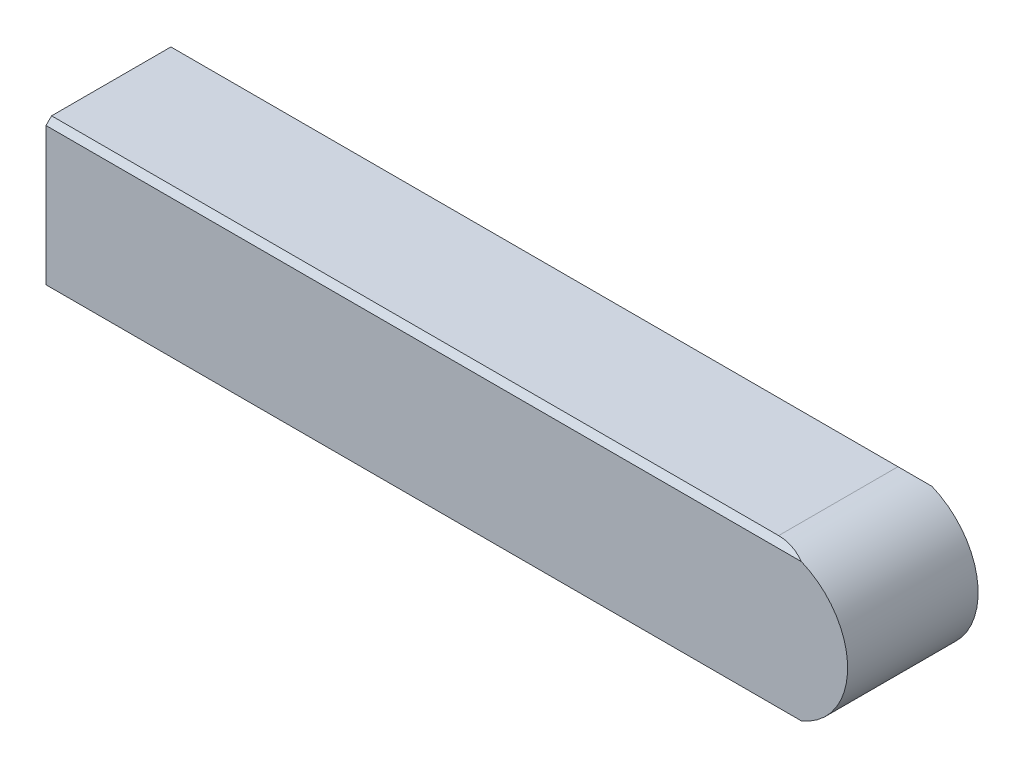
ISO-10303-21;
HEADER;
FILE_DESCRIPTION(('STEP AP214'),'2;1');
FILE_NAME('part.step','',(''),(''),'','','');
FILE_SCHEMA(('AUTOMOTIVE_DESIGN { 1 0 10303 214 1 1 1 1 }'));
ENDSEC;
DATA;
#1=APPLICATION_CONTEXT('core data for automotive mechanical design processes');
#2=APPLICATION_PROTOCOL_DEFINITION('international standard','automotive_design',2000,#1);
#3=PRODUCT_CONTEXT('',#1,'mechanical');
#4=PRODUCT('Part','Part','',(#3));
#5=PRODUCT_RELATED_PRODUCT_CATEGORY('part','',(#4));
#6=PRODUCT_DEFINITION_FORMATION('','',#4);
#7=PRODUCT_DEFINITION_CONTEXT('part definition',#1,'design');
#8=PRODUCT_DEFINITION('design','',#6,#7);
#9=PRODUCT_DEFINITION_SHAPE('','',#8);
#10=(LENGTH_UNIT() NAMED_UNIT(*) SI_UNIT(.MILLI.,.METRE.));
#11=(NAMED_UNIT(*) PLANE_ANGLE_UNIT() SI_UNIT($,.RADIAN.));
#12=(NAMED_UNIT(*) SI_UNIT($,.STERADIAN.) SOLID_ANGLE_UNIT());
#13=UNCERTAINTY_MEASURE_WITH_UNIT(LENGTH_MEASURE(1.E-05),#10,'distance_accuracy_value','');
#14=(GEOMETRIC_REPRESENTATION_CONTEXT(3) GLOBAL_UNCERTAINTY_ASSIGNED_CONTEXT((#13)) GLOBAL_UNIT_ASSIGNED_CONTEXT((#10,
#11,#12)) REPRESENTATION_CONTEXT('',''));
#15=CARTESIAN_POINT('',(0.,0.,0.));
#16=DIRECTION('',(0.,0.,1.));
#17=DIRECTION('',(1.,0.,0.));
#18=AXIS2_PLACEMENT_3D('',#15,#16,#17);
#19=CARTESIAN_POINT('',(0.,8.,7.));
#20=DIRECTION('',(1.,0.,0.));
#21=DIRECTION('',(0.,0.,-1.));
#22=AXIS2_PLACEMENT_3D('',#19,#20,#21);
#23=PLANE('',#22);
#24=DIRECTION('',(0.,0.,-1.));
#25=VECTOR('',#24,1.);
#26=CARTESIAN_POINT('',(0.,0.,7.));
#27=LINE('',#26,#25);
#28=CARTESIAN_POINT('',(0.,0.,6.7));
#29=VERTEX_POINT('',#28);
#30=CARTESIAN_POINT('',(0.,0.,0.3));
#31=VERTEX_POINT('',#30);
#32=EDGE_CURVE('E133',#29,#31,#27,.T.);
#33=ORIENTED_EDGE('',*,*,#32,.F.);
#34=DIRECTION('',(0.,-0.707106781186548,-0.707106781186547));
#35=VECTOR('',#34,1.);
#36=CARTESIAN_POINT('',(0.,0.3,7.));
#37=LINE('',#36,#35);
#38=CARTESIAN_POINT('',(0.,0.3,7.));
#39=VERTEX_POINT('',#38);
#40=EDGE_CURVE('E122',#39,#29,#37,.T.);
#41=ORIENTED_EDGE('',*,*,#40,.F.);
#42=DIRECTION('',(0.,-1.,0.));
#43=VECTOR('',#42,1.);
#44=CARTESIAN_POINT('',(0.,8.,7.));
#45=LINE('',#44,#43);
#46=CARTESIAN_POINT('',(0.,7.7,7.));
#47=VERTEX_POINT('',#46);
#48=EDGE_CURVE('E130',#47,#39,#45,.T.);
#49=ORIENTED_EDGE('',*,*,#48,.F.);
#50=DIRECTION('',(0.,-0.707106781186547,0.707106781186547));
#51=VECTOR('',#50,1.);
#52=CARTESIAN_POINT('',(0.,8.,6.7));
#53=LINE('',#52,#51);
#54=CARTESIAN_POINT('',(0.,8.,6.7));
#55=VERTEX_POINT('',#54);
#56=EDGE_CURVE('E70',#55,#47,#53,.T.);
#57=ORIENTED_EDGE('',*,*,#56,.F.);
#58=DIRECTION('',(0.,0.,-1.));
#59=VECTOR('',#58,1.);
#60=CARTESIAN_POINT('',(0.,8.,7.));
#61=LINE('',#60,#59);
#62=CARTESIAN_POINT('',(0.,8.,0.3));
#63=VERTEX_POINT('',#62);
#64=EDGE_CURVE('E145',#55,#63,#61,.T.);
#65=ORIENTED_EDGE('',*,*,#64,.T.);
#66=DIRECTION('',(0.,0.707106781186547,0.707106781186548));
#67=VECTOR('',#66,1.);
#68=CARTESIAN_POINT('',(0.,7.7,0.));
#69=LINE('',#68,#67);
#70=CARTESIAN_POINT('',(0.,7.7,0.));
#71=VERTEX_POINT('',#70);
#72=EDGE_CURVE('E209',#71,#63,#69,.T.);
#73=ORIENTED_EDGE('',*,*,#72,.F.);
#74=DIRECTION('',(0.,-1.,0.));
#75=VECTOR('',#74,1.);
#76=CARTESIAN_POINT('',(0.,8.,0.));
#77=LINE('',#76,#75);
#78=CARTESIAN_POINT('',(0.,0.3,0.));
#79=VERTEX_POINT('',#78);
#80=EDGE_CURVE('E148',#71,#79,#77,.T.);
#81=ORIENTED_EDGE('',*,*,#80,.T.);
#82=DIRECTION('',(0.,0.707106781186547,-0.707106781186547));
#83=VECTOR('',#82,1.);
#84=CARTESIAN_POINT('',(0.,0.,0.3));
#85=LINE('',#84,#83);
#86=EDGE_CURVE('E135',#31,#79,#85,.T.);
#87=ORIENTED_EDGE('',*,*,#86,.F.);
#88=EDGE_LOOP('',(#33,#41,#49,#57,#65,#73,#81,#87));
#89=FACE_BOUND('',#88,.T.);
#90=ADVANCED_FACE('F42',(#89),#23,.F.);
#91=CARTESIAN_POINT('',(0.,0.,7.));
#92=DIRECTION('',(0.,1.,0.));
#93=DIRECTION('',(0.,0.,1.));
#94=AXIS2_PLACEMENT_3D('',#91,#92,#93);
#95=PLANE('',#94);
#96=DIRECTION('',(0.,0.,-1.));
#97=VECTOR('',#96,1.);
#98=CARTESIAN_POINT('',(39.,0.,7.));
#99=LINE('',#98,#97);
#100=CARTESIAN_POINT('',(38.9999999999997,0.,6.7));
#101=VERTEX_POINT('',#100);
#102=CARTESIAN_POINT('',(38.9999999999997,2.98372437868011E-13,0.299999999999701));
#103=VERTEX_POINT('',#102);
#104=EDGE_CURVE('E163',#101,#103,#99,.T.);
#105=ORIENTED_EDGE('',*,*,#104,.F.);
#106=DIRECTION('',(-1.,0.,0.));
#107=VECTOR('',#106,1.);
#108=CARTESIAN_POINT('',(43.,0.,6.7));
#109=LINE('',#108,#107);
#110=EDGE_CURVE('E197',#101,#29,#109,.T.);
#111=ORIENTED_EDGE('',*,*,#110,.T.);
#112=ORIENTED_EDGE('',*,*,#32,.T.);
#113=DIRECTION('',(-1.,0.,0.));
#114=VECTOR('',#113,1.);
#115=CARTESIAN_POINT('',(43.,0.,0.3));
#116=LINE('',#115,#114);
#117=EDGE_CURVE('E200',#103,#31,#116,.T.);
#118=ORIENTED_EDGE('',*,*,#117,.F.);
#119=EDGE_LOOP('',(#105,#111,#112,#118));
#120=FACE_BOUND('',#119,.T.);
#121=ADVANCED_FACE('F233',(#120),#95,.F.);
#122=CARTESIAN_POINT('',(38.9999999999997,4.0000000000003,7.));
#123=DIRECTION('',(0.,0.,-1.));
#124=DIRECTION('',(-1.,0.,0.));
#125=AXIS2_PLACEMENT_3D('',#122,#123,#124);
#126=CYLINDRICAL_SURFACE('',#125,4.);
#127=CARTESIAN_POINT('',(38.9999999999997,4.0000000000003,7.));
#128=DIRECTION('',(0.,0.,1.));
#129=DIRECTION('',(1.,0.,0.));
#130=AXIS2_PLACEMENT_3D('',#127,#128,#129);
#131=CIRCLE('',#130,4.00000000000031);
#132=CARTESIAN_POINT('',(40.5198684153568,0.3,7.));
#133=VERTEX_POINT('',#132);
#134=CARTESIAN_POINT('',(40.5198684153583,7.7,7.));
#135=VERTEX_POINT('',#134);
#136=EDGE_CURVE('E139',#133,#135,#131,.T.);
#137=ORIENTED_EDGE('',*,*,#136,.F.);
#138=CARTESIAN_POINT('',(38.9999999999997,4.0000000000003,10.7000000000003));
#139=DIRECTION('',(0.,0.707106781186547,-0.707106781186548));
#140=DIRECTION('',(0.,-0.707106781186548,-0.707106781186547));
#141=AXIS2_PLACEMENT_3D('',#138,#139,#140);
#142=ELLIPSE('',#141,5.65685424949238,4.);
#143=EDGE_CURVE('E59',#133,#101,#142,.T.);
#144=ORIENTED_EDGE('',*,*,#143,.T.);
#145=ORIENTED_EDGE('',*,*,#104,.T.);
#146=CARTESIAN_POINT('',(38.9999999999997,4.0000000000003,-3.7000000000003));
#147=DIRECTION('',(0.,0.707106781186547,0.707106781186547));
#148=DIRECTION('',(0.,0.707106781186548,-0.707106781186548));
#149=AXIS2_PLACEMENT_3D('',#146,#147,#148);
#150=ELLIPSE('',#149,5.65685424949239,4.);
#151=CARTESIAN_POINT('',(40.519868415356,0.3,0.));
#152=VERTEX_POINT('',#151);
#153=EDGE_CURVE('E188',#103,#152,#150,.T.);
#154=ORIENTED_EDGE('',*,*,#153,.T.);
#155=CARTESIAN_POINT('',(38.9999999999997,4.0000000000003,0.));
#156=DIRECTION('',(0.,0.,1.));
#157=DIRECTION('',(1.,0.,0.));
#158=AXIS2_PLACEMENT_3D('',#155,#156,#157);
#159=CIRCLE('',#158,4.);
#160=CARTESIAN_POINT('',(40.5198684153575,7.7,0.));
#161=VERTEX_POINT('',#160);
#162=EDGE_CURVE('E140',#152,#161,#159,.T.);
#163=ORIENTED_EDGE('',*,*,#162,.T.);
#164=CARTESIAN_POINT('',(38.9999999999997,4.0000000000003,-3.6999999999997));
#165=DIRECTION('',(0.,-0.707106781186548,0.707106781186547));
#166=DIRECTION('',(0.,-0.707106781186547,-0.707106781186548));
#167=AXIS2_PLACEMENT_3D('',#164,#165,#166);
#168=ELLIPSE('',#167,5.65685424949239,4.);
#169=CARTESIAN_POINT('',(39.,8.,0.3));
#170=VERTEX_POINT('',#169);
#171=EDGE_CURVE('E193',#161,#170,#168,.T.);
#172=ORIENTED_EDGE('',*,*,#171,.T.);
#173=DIRECTION('',(0.,0.,-1.));
#174=VECTOR('',#173,1.);
#175=CARTESIAN_POINT('',(39.,8.00000000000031,7.));
#176=LINE('',#175,#174);
#177=CARTESIAN_POINT('',(39.,8.,6.7));
#178=VERTEX_POINT('',#177);
#179=EDGE_CURVE('E159',#178,#170,#176,.T.);
#180=ORIENTED_EDGE('',*,*,#179,.F.);
#181=CARTESIAN_POINT('',(38.9999999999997,4.0000000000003,10.6999999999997));
#182=DIRECTION('',(0.,-0.707106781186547,-0.707106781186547));
#183=DIRECTION('',(0.,0.707106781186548,-0.707106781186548));
#184=AXIS2_PLACEMENT_3D('',#181,#182,#183);
#185=ELLIPSE('',#184,5.65685424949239,4.);
#186=EDGE_CURVE('E181',#178,#135,#185,.T.);
#187=ORIENTED_EDGE('',*,*,#186,.T.);
#188=EDGE_LOOP('',(#137,#144,#145,#154,#163,#172,#180,#187));
#189=FACE_BOUND('',#188,.T.);
#190=ADVANCED_FACE('F185',(#189),#126,.T.);
#191=CARTESIAN_POINT('',(39.,8.,7.));
#192=DIRECTION('',(0.,-1.,0.));
#193=DIRECTION('',(0.,0.,-1.));
#194=AXIS2_PLACEMENT_3D('',#191,#192,#193);
#195=PLANE('',#194);
#196=ORIENTED_EDGE('',*,*,#179,.T.);
#197=DIRECTION('',(-1.,0.,0.));
#198=VECTOR('',#197,1.);
#199=CARTESIAN_POINT('',(43.,8.,0.3));
#200=LINE('',#199,#198);
#201=EDGE_CURVE('E202',#170,#63,#200,.T.);
#202=ORIENTED_EDGE('',*,*,#201,.T.);
#203=ORIENTED_EDGE('',*,*,#64,.F.);
#204=DIRECTION('',(-1.,0.,0.));
#205=VECTOR('',#204,1.);
#206=CARTESIAN_POINT('',(43.,8.,6.7));
#207=LINE('',#206,#205);
#208=EDGE_CURVE('E205',#178,#55,#207,.T.);
#209=ORIENTED_EDGE('',*,*,#208,.F.);
#210=EDGE_LOOP('',(#196,#202,#203,#209));
#211=FACE_BOUND('',#210,.T.);
#212=ADVANCED_FACE('F225',(#211),#195,.F.);
#213=CARTESIAN_POINT('',(38.9999999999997,4.0000000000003,7.));
#214=DIRECTION('',(0.,0.,1.));
#215=DIRECTION('',(1.,0.,0.));
#216=AXIS2_PLACEMENT_3D('',#213,#214,#215);
#217=PLANE('',#216);
#218=DIRECTION('',(-1.,0.,0.));
#219=VECTOR('',#218,1.);
#220=CARTESIAN_POINT('',(38.9999999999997,0.3,7.));
#221=LINE('',#220,#219);
#222=EDGE_CURVE('E11',#133,#39,#221,.T.);
#223=ORIENTED_EDGE('',*,*,#222,.F.);
#224=ORIENTED_EDGE('',*,*,#136,.T.);
#225=DIRECTION('',(1.,0.,0.));
#226=VECTOR('',#225,1.);
#227=CARTESIAN_POINT('',(38.9999999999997,7.7,7.));
#228=LINE('',#227,#226);
#229=EDGE_CURVE('E50',#47,#135,#228,.T.);
#230=ORIENTED_EDGE('',*,*,#229,.F.);
#231=ORIENTED_EDGE('',*,*,#48,.T.);
#232=EDGE_LOOP('',(#223,#224,#230,#231));
#233=FACE_BOUND('',#232,.T.);
#234=ADVANCED_FACE('F137',(#233),#217,.T.);
#235=CARTESIAN_POINT('',(38.9999999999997,4.0000000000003,0.));
#236=DIRECTION('',(0.,0.,1.));
#237=DIRECTION('',(1.,0.,0.));
#238=AXIS2_PLACEMENT_3D('',#235,#236,#237);
#239=PLANE('',#238);
#240=ORIENTED_EDGE('',*,*,#162,.F.);
#241=DIRECTION('',(-1.,0.,0.));
#242=VECTOR('',#241,1.);
#243=CARTESIAN_POINT('',(38.9999999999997,0.3,0.));
#244=LINE('',#243,#242);
#245=EDGE_CURVE('E173',#152,#79,#244,.T.);
#246=ORIENTED_EDGE('',*,*,#245,.T.);
#247=ORIENTED_EDGE('',*,*,#80,.F.);
#248=DIRECTION('',(1.,0.,0.));
#249=VECTOR('',#248,1.);
#250=CARTESIAN_POINT('',(38.9999999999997,7.7,0.));
#251=LINE('',#250,#249);
#252=EDGE_CURVE('E169',#71,#161,#251,.T.);
#253=ORIENTED_EDGE('',*,*,#252,.T.);
#254=EDGE_LOOP('',(#240,#246,#247,#253));
#255=FACE_BOUND('',#254,.T.);
#256=ADVANCED_FACE('F218',(#255),#239,.F.);
#257=CARTESIAN_POINT('',(43.,7.7,0.));
#258=DIRECTION('',(0.,-0.707106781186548,0.707106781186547));
#259=DIRECTION('',(0.,-0.707106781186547,-0.707106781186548));
#260=AXIS2_PLACEMENT_3D('',#257,#258,#259);
#261=PLANE('',#260);
#262=ORIENTED_EDGE('',*,*,#252,.F.);
#263=ORIENTED_EDGE('',*,*,#72,.T.);
#264=ORIENTED_EDGE('',*,*,#201,.F.);
#265=ORIENTED_EDGE('',*,*,#171,.F.);
#266=EDGE_LOOP('',(#262,#263,#264,#265));
#267=FACE_BOUND('',#266,.T.);
#268=ADVANCED_FACE('F222',(#267),#261,.F.);
#269=CARTESIAN_POINT('',(43.,0.,0.3));
#270=DIRECTION('',(0.,0.707106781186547,0.707106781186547));
#271=DIRECTION('',(0.,-0.707106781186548,0.707106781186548));
#272=AXIS2_PLACEMENT_3D('',#269,#270,#271);
#273=PLANE('',#272);
#274=ORIENTED_EDGE('',*,*,#117,.T.);
#275=ORIENTED_EDGE('',*,*,#86,.T.);
#276=ORIENTED_EDGE('',*,*,#245,.F.);
#277=ORIENTED_EDGE('',*,*,#153,.F.);
#278=EDGE_LOOP('',(#274,#275,#276,#277));
#279=FACE_BOUND('',#278,.T.);
#280=ADVANCED_FACE('F213',(#279),#273,.F.);
#281=CARTESIAN_POINT('',(43.,8.,6.7));
#282=DIRECTION('',(0.,-0.707106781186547,-0.707106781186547));
#283=DIRECTION('',(0.,0.707106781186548,-0.707106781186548));
#284=AXIS2_PLACEMENT_3D('',#281,#282,#283);
#285=PLANE('',#284);
#286=ORIENTED_EDGE('',*,*,#208,.T.);
#287=ORIENTED_EDGE('',*,*,#56,.T.);
#288=ORIENTED_EDGE('',*,*,#229,.T.);
#289=ORIENTED_EDGE('',*,*,#186,.F.);
#290=EDGE_LOOP('',(#286,#287,#288,#289));
#291=FACE_BOUND('',#290,.T.);
#292=ADVANCED_FACE('F180',(#291),#285,.F.);
#293=CARTESIAN_POINT('',(43.,0.3,7.));
#294=DIRECTION('',(0.,0.707106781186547,-0.707106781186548));
#295=DIRECTION('',(0.,0.707106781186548,0.707106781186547));
#296=AXIS2_PLACEMENT_3D('',#293,#294,#295);
#297=PLANE('',#296);
#298=ORIENTED_EDGE('',*,*,#222,.T.);
#299=ORIENTED_EDGE('',*,*,#40,.T.);
#300=ORIENTED_EDGE('',*,*,#110,.F.);
#301=ORIENTED_EDGE('',*,*,#143,.F.);
#302=EDGE_LOOP('',(#298,#299,#300,#301));
#303=FACE_BOUND('',#302,.T.);
#304=ADVANCED_FACE('F121',(#303),#297,.F.);
#305=CLOSED_SHELL('',(#90,#121,#190,#212,#234,#256,#268,#280,#292,#304));
#306=MANIFOLD_SOLID_BREP('B2',#305);
#307=ADVANCED_BREP_SHAPE_REPRESENTATION('',(#18,#306),#14);
#308=SHAPE_DEFINITION_REPRESENTATION(#9,#307);
ENDSEC;
END-ISO-10303-21;
